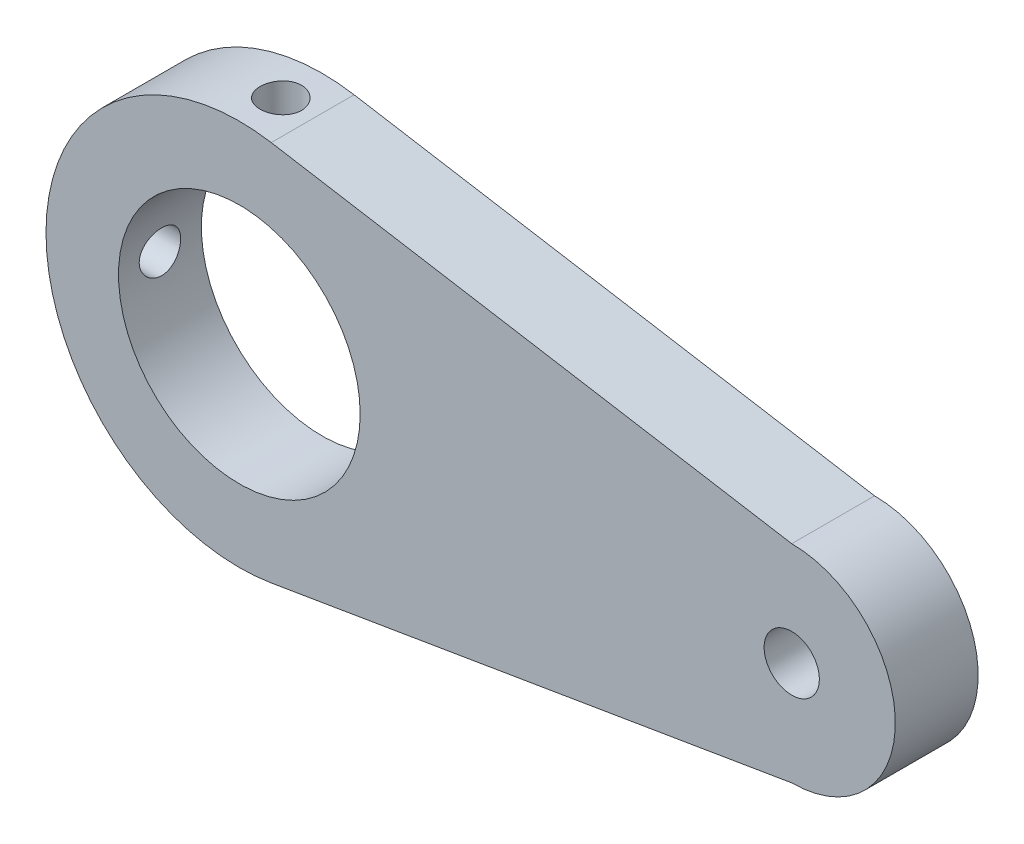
from build123d import *

# Parameters (mm, degrees)
SKETCH_1_R          = 17.5
SKETCH_1_R_2        = 4
EXTRUDE_1_DEPTH     = 12
SKETCH_2_R          = 3
CUT_EXTRUDE_1_DEPTH = 12
SKETCH_3_R          = 3
CUT_EXTRUDE_2_DEPTH = 16


with BuildPart() as part:
    # Sketch 1 → Extrude 1 (new body)
    with BuildSketch(Plane.XY):
        with BuildLine():
            Line((4.62202222, 27.615881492), (80, 15))
            ThreePointArc((80, 15), (95, 0), (80, -15))
            Line((80, -15), (4.62202222, -27.615881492))
            ThreePointArc((4.62202222, -27.615881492), (-28, 0), (4.62202222, 27.615881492))
        make_face()
        Circle(SKETCH_1_R, mode=Mode.SUBTRACT)
        with Locations((80, 0)):
            Circle(SKETCH_1_R_2, mode=Mode.SUBTRACT)
    extrude(amount=EXTRUDE_1_DEPTH)

    # Sketch 2 → Cut-Extrude 1 (cut)
    with BuildSketch(Plane(origin=(0, 28, 0), x_dir=(1, 0, 0), z_dir=(0, 1, 0))):
        with Locations(Location((0, -6, 0), (0, 0, 270))):
            Circle(SKETCH_2_R)
    extrude(amount=-CUT_EXTRUDE_1_DEPTH, mode=Mode.SUBTRACT)

    # Sketch 3 → Cut-Extrude 2 (cut)
    with BuildSketch(Plane(origin=(-28, 0, 0), x_dir=(0, 0, -1), z_dir=(1, 0, 0))):
        with Locations(Location((-6, 0, 0), (0, 0, 180))):
            Circle(SKETCH_3_R)
    extrude(amount=CUT_EXTRUDE_2_DEPTH, mode=Mode.SUBTRACT)


solid = part.part
